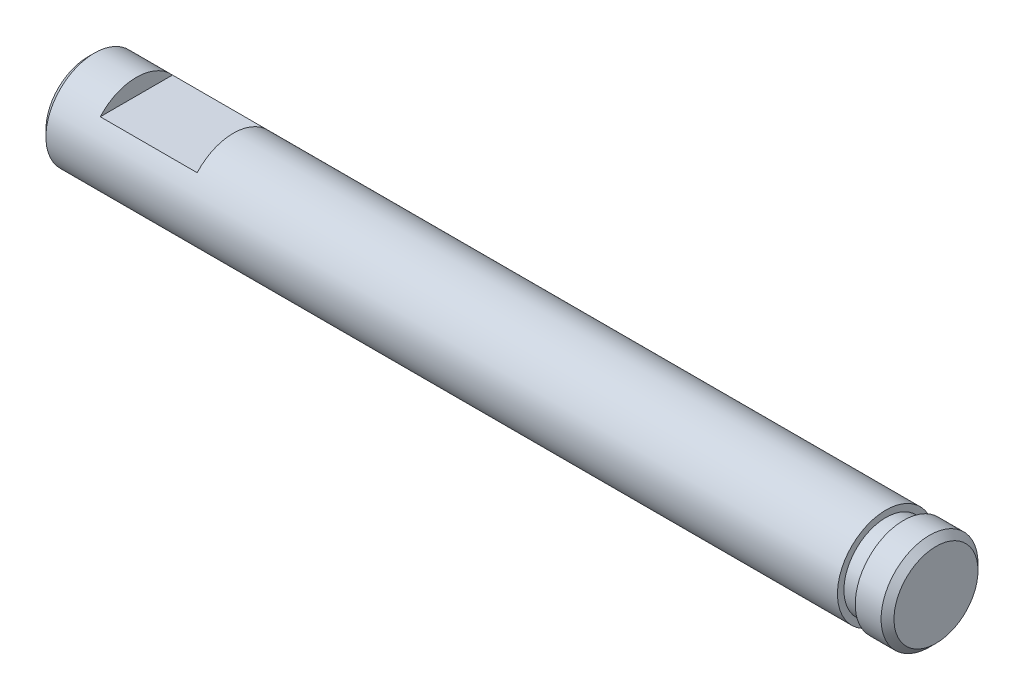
from build123d import *

# Parameters (mm, degrees)
CORTE_EXTRUS_O1_DEPTH      = 27.335574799
CORTE_EXTRUS_O1_DEPTH_BACK = 27.335574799
ESBO_O2_W                  = 3
ESBO_O2_H                  = 0.5


with BuildPart() as part:
    # Esbo_o1 → Revolu_o1 (revolve)
    with BuildSketch(Plane.XY, mode=Mode.PRIVATE) as revolu_o1_sk:
        Polygon((0, 0), (0, 1.3), (0.2, 1.5), (24.7, 1.5), (24.7, 1.3), (25.25, 1.3), (25.25, 1.5), (26.05, 1.5), (26.25, 1.3), (26.25, 0), align=None)
    revolve(revolu_o1_sk.sketch.rotate(Axis((26.25, 0, 0), (-1, 0, 0)), 90), axis=Axis((26.25, 0, 0), (-1, 0, 0)))

    # Esbo_o2 → Corte-extrus_o1 (cut, two sides: drawn at the far end of the back side and taken through both)
    with BuildSketch(Plane.XY.offset(-CORTE_EXTRUS_O1_DEPTH_BACK)):
        with Locations((3, 1.25)):
            Rectangle(ESBO_O2_W, ESBO_O2_H)
    extrude(amount=CORTE_EXTRUS_O1_DEPTH + CORTE_EXTRUS_O1_DEPTH_BACK, mode=Mode.SUBTRACT)


solid = part.part
